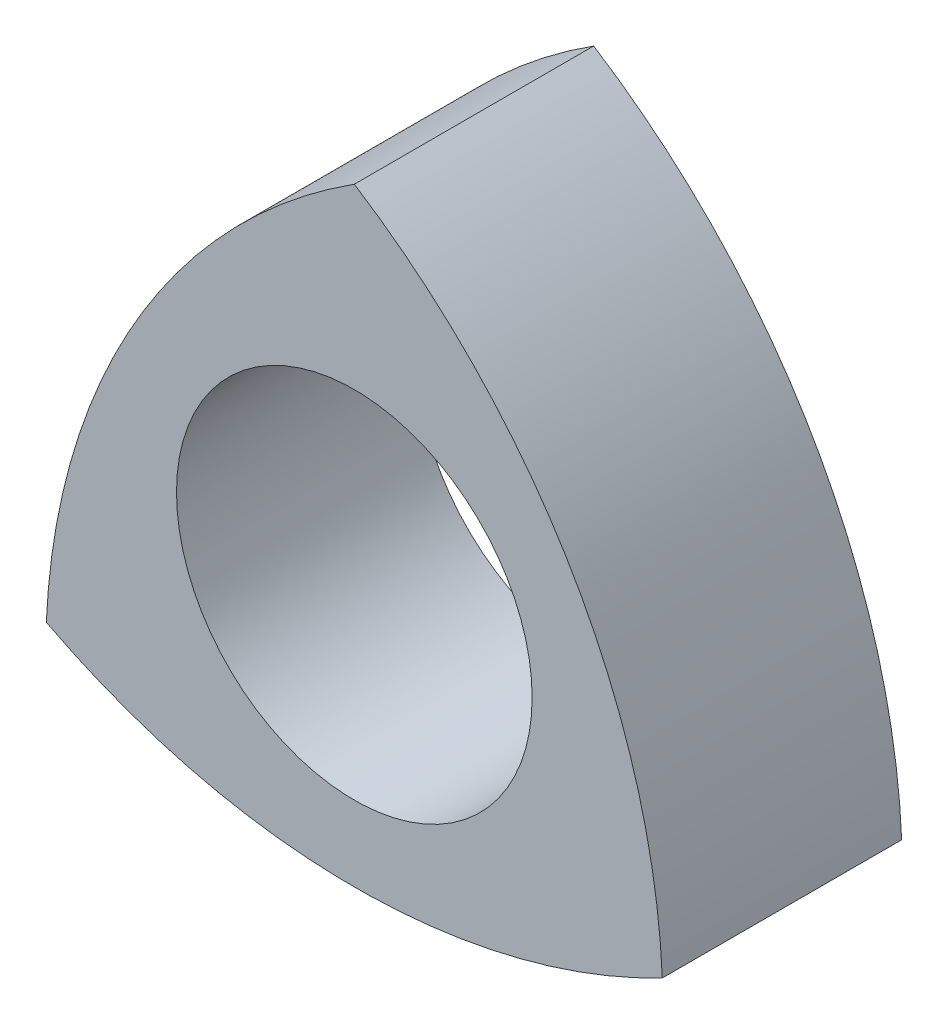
from build123d import *

# Parameters (mm, degrees)
SKETCH1_R           = 132.08
BOSS_EXTRUDE1_DEPTH = 177.8


with BuildPart() as part:
    # Sketch1 → Boss-Extrude1 (new body)
    with BuildSketch(Plane.XY):
        with BuildLine():
            ThreePointArc((0, 264.16), (162.77813388, 93.979999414), (228.769270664, -132.08))
            ThreePointArc((228.769270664, -132.08), (0, -187.959998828), (-228.769270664, -132.08))
            ThreePointArc((-228.769270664, -132.08), (-162.77813388, 93.979999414), (0, 264.16))
        make_face()
        Circle(SKETCH1_R, mode=Mode.SUBTRACT)
    extrude(amount=BOSS_EXTRUDE1_DEPTH)


solid = part.part
